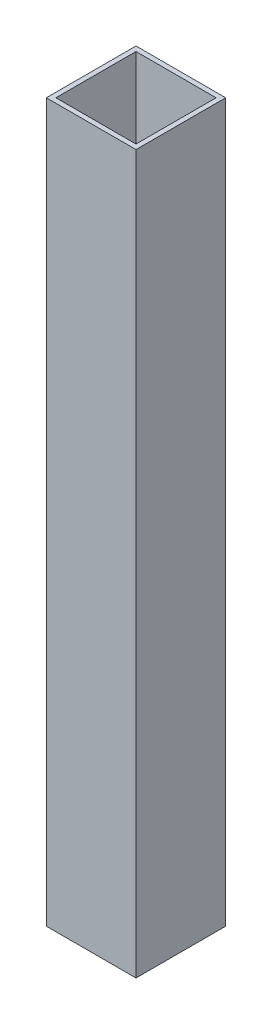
from build123d import *

# Parameters (mm, degrees)
SKETCH1_W           = 76.2
SKETCH1_H           = 76.2
SKETCH1_W_2         = 68.072
SKETCH1_H_2         = 68.072
BOSS_EXTRUDE1_DEPTH = 609.6


with BuildPart() as part:
    # Sketch1 → Boss-Extrude1 (new body)
    with BuildSketch(Plane(origin=(0, 0, 0), x_dir=(1, 0, 0), z_dir=(0, 1, 0))):
        Rectangle(SKETCH1_W, SKETCH1_H)
        Rectangle(SKETCH1_W_2, SKETCH1_H_2, mode=Mode.SUBTRACT)
    extrude(amount=BOSS_EXTRUDE1_DEPTH)


solid = part.part
